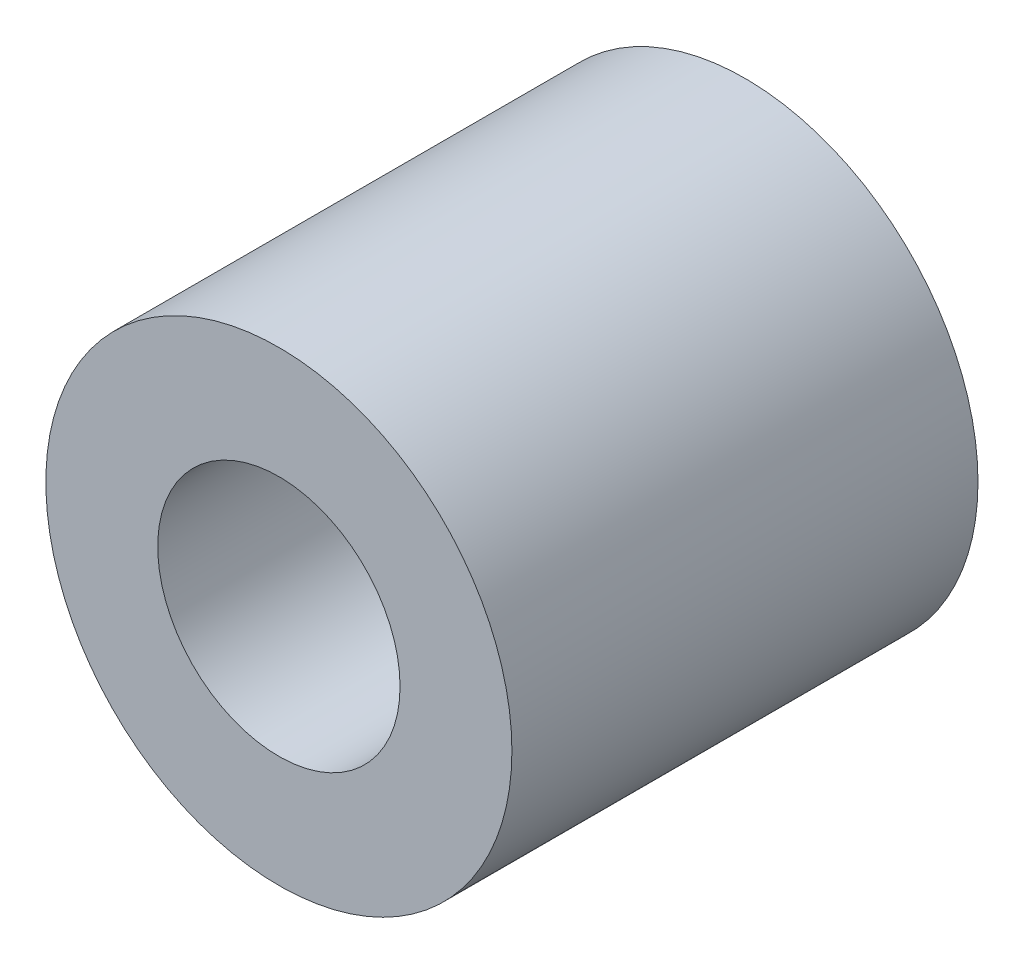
ISO-10303-21;
HEADER;
FILE_DESCRIPTION(('STEP AP214'),'2;1');
FILE_NAME('part.step','',(''),(''),'','','');
FILE_SCHEMA(('AUTOMOTIVE_DESIGN { 1 0 10303 214 1 1 1 1 }'));
ENDSEC;
DATA;
#1=APPLICATION_CONTEXT('core data for automotive mechanical design processes');
#2=APPLICATION_PROTOCOL_DEFINITION('international standard','automotive_design',2000,#1);
#3=PRODUCT_CONTEXT('',#1,'mechanical');
#4=PRODUCT('Part','Part','',(#3));
#5=PRODUCT_RELATED_PRODUCT_CATEGORY('part','',(#4));
#6=PRODUCT_DEFINITION_FORMATION('','',#4);
#7=PRODUCT_DEFINITION_CONTEXT('part definition',#1,'design');
#8=PRODUCT_DEFINITION('design','',#6,#7);
#9=PRODUCT_DEFINITION_SHAPE('','',#8);
#10=(LENGTH_UNIT() NAMED_UNIT(*) SI_UNIT(.MILLI.,.METRE.));
#11=(NAMED_UNIT(*) PLANE_ANGLE_UNIT() SI_UNIT($,.RADIAN.));
#12=(NAMED_UNIT(*) SI_UNIT($,.STERADIAN.) SOLID_ANGLE_UNIT());
#13=UNCERTAINTY_MEASURE_WITH_UNIT(LENGTH_MEASURE(1.E-05),#10,'distance_accuracy_value','');
#14=(GEOMETRIC_REPRESENTATION_CONTEXT(3) GLOBAL_UNCERTAINTY_ASSIGNED_CONTEXT((#13)) GLOBAL_UNIT_ASSIGNED_CONTEXT((#10,
#11,#12)) REPRESENTATION_CONTEXT('',''));
#15=CARTESIAN_POINT('',(0.,0.,0.));
#16=DIRECTION('',(0.,0.,1.));
#17=DIRECTION('',(1.,0.,0.));
#18=AXIS2_PLACEMENT_3D('',#15,#16,#17);
#19=CARTESIAN_POINT('',(0.,0.,40.));
#20=DIRECTION('',(0.,0.,1.));
#21=DIRECTION('',(1.,0.,0.));
#22=AXIS2_PLACEMENT_3D('',#19,#20,#21);
#23=CYLINDRICAL_SURFACE('',#22,8.);
#24=CARTESIAN_POINT('',(0.,0.,0.));
#25=DIRECTION('',(0.,0.,1.));
#26=DIRECTION('',(1.,0.,0.));
#27=AXIS2_PLACEMENT_3D('',#24,#25,#26);
#28=CIRCLE('',#27,8.);
#29=CARTESIAN_POINT('',(8.,0.,0.));
#30=VERTEX_POINT('',#29);
#31=EDGE_CURVE('E8',#30,#30,#28,.T.);
#32=ORIENTED_EDGE('',*,*,#31,.F.);
#33=EDGE_LOOP('',(#32));
#34=FACE_BOUND('',#33,.T.);
#35=CARTESIAN_POINT('',(0.,0.,15.));
#36=DIRECTION('',(0.,0.,1.));
#37=DIRECTION('',(1.,0.,0.));
#38=AXIS2_PLACEMENT_3D('',#35,#36,#37);
#39=CIRCLE('',#38,8.);
#40=CARTESIAN_POINT('',(8.,0.,15.));
#41=VERTEX_POINT('',#40);
#42=EDGE_CURVE('E34',#41,#41,#39,.T.);
#43=ORIENTED_EDGE('',*,*,#42,.T.);
#44=EDGE_LOOP('',(#43));
#45=FACE_BOUND('',#44,.T.);
#46=ADVANCED_FACE('F12',(#34,#45),#23,.F.);
#47=CARTESIAN_POINT('',(8.,0.,0.));
#48=DIRECTION('',(0.,0.,1.));
#49=DIRECTION('',(1.,0.,0.));
#50=AXIS2_PLACEMENT_3D('',#47,#48,#49);
#51=PLANE('',#50);
#52=CARTESIAN_POINT('',(0.,0.,0.));
#53=DIRECTION('',(0.,0.,1.));
#54=DIRECTION('',(1.,0.,0.));
#55=AXIS2_PLACEMENT_3D('',#52,#53,#54);
#56=CIRCLE('',#55,25.);
#57=CARTESIAN_POINT('',(25.,0.,0.));
#58=VERTEX_POINT('',#57);
#59=EDGE_CURVE('E18',#58,#58,#56,.T.);
#60=ORIENTED_EDGE('',*,*,#59,.F.);
#61=EDGE_LOOP('',(#60));
#62=FACE_BOUND('',#61,.T.);
#63=ORIENTED_EDGE('',*,*,#31,.T.);
#64=EDGE_LOOP('',(#63));
#65=FACE_BOUND('',#64,.T.);
#66=ADVANCED_FACE('F59',(#62,#65),#51,.F.);
#67=CARTESIAN_POINT('',(0.,0.,40.));
#68=DIRECTION('',(0.,0.,1.));
#69=DIRECTION('',(1.,0.,0.));
#70=AXIS2_PLACEMENT_3D('',#67,#68,#69);
#71=CYLINDRICAL_SURFACE('',#70,25.);
#72=CARTESIAN_POINT('',(0.,0.,50.));
#73=DIRECTION('',(0.,0.,1.));
#74=DIRECTION('',(1.,0.,0.));
#75=AXIS2_PLACEMENT_3D('',#72,#73,#74);
#76=CIRCLE('',#75,25.);
#77=CARTESIAN_POINT('',(25.,0.,50.));
#78=VERTEX_POINT('',#77);
#79=EDGE_CURVE('E22',#78,#78,#76,.T.);
#80=ORIENTED_EDGE('',*,*,#79,.F.);
#81=EDGE_LOOP('',(#80));
#82=FACE_BOUND('',#81,.T.);
#83=ORIENTED_EDGE('',*,*,#59,.T.);
#84=EDGE_LOOP('',(#83));
#85=FACE_BOUND('',#84,.T.);
#86=ADVANCED_FACE('F54',(#82,#85),#71,.T.);
#87=CARTESIAN_POINT('',(25.,0.,50.));
#88=DIRECTION('',(0.,0.,-1.));
#89=DIRECTION('',(-1.,0.,0.));
#90=AXIS2_PLACEMENT_3D('',#87,#88,#89);
#91=PLANE('',#90);
#92=CARTESIAN_POINT('',(0.,0.,50.));
#93=DIRECTION('',(0.,0.,1.));
#94=DIRECTION('',(1.,0.,0.));
#95=AXIS2_PLACEMENT_3D('',#92,#93,#94);
#96=CIRCLE('',#95,13.);
#97=CARTESIAN_POINT('',(13.,0.,50.));
#98=VERTEX_POINT('',#97);
#99=EDGE_CURVE('E26',#98,#98,#96,.T.);
#100=ORIENTED_EDGE('',*,*,#99,.F.);
#101=EDGE_LOOP('',(#100));
#102=FACE_BOUND('',#101,.T.);
#103=ORIENTED_EDGE('',*,*,#79,.T.);
#104=EDGE_LOOP('',(#103));
#105=FACE_BOUND('',#104,.T.);
#106=ADVANCED_FACE('F48',(#102,#105),#91,.F.);
#107=CARTESIAN_POINT('',(0.,0.,40.));
#108=DIRECTION('',(0.,0.,1.));
#109=DIRECTION('',(1.,0.,0.));
#110=AXIS2_PLACEMENT_3D('',#107,#108,#109);
#111=CYLINDRICAL_SURFACE('',#110,13.);
#112=CARTESIAN_POINT('',(0.,0.,15.));
#113=DIRECTION('',(0.,0.,1.));
#114=DIRECTION('',(1.,0.,0.));
#115=AXIS2_PLACEMENT_3D('',#112,#113,#114);
#116=CIRCLE('',#115,13.);
#117=CARTESIAN_POINT('',(13.,0.,15.));
#118=VERTEX_POINT('',#117);
#119=EDGE_CURVE('E31',#118,#118,#116,.T.);
#120=ORIENTED_EDGE('',*,*,#119,.F.);
#121=EDGE_LOOP('',(#120));
#122=FACE_BOUND('',#121,.T.);
#123=ORIENTED_EDGE('',*,*,#99,.T.);
#124=EDGE_LOOP('',(#123));
#125=FACE_BOUND('',#124,.T.);
#126=ADVANCED_FACE('F42',(#122,#125),#111,.F.);
#127=CARTESIAN_POINT('',(13.,0.,15.));
#128=DIRECTION('',(0.,0.,-1.));
#129=DIRECTION('',(-1.,0.,0.));
#130=AXIS2_PLACEMENT_3D('',#127,#128,#129);
#131=PLANE('',#130);
#132=ORIENTED_EDGE('',*,*,#42,.F.);
#133=EDGE_LOOP('',(#132));
#134=FACE_BOUND('',#133,.T.);
#135=ORIENTED_EDGE('',*,*,#119,.T.);
#136=EDGE_LOOP('',(#135));
#137=FACE_BOUND('',#136,.T.);
#138=ADVANCED_FACE('F39',(#134,#137),#131,.F.);
#139=CLOSED_SHELL('',(#46,#66,#86,#106,#126,#138));
#140=MANIFOLD_SOLID_BREP('B1',#139);
#141=ADVANCED_BREP_SHAPE_REPRESENTATION('',(#18,#140),#14);
#142=SHAPE_DEFINITION_REPRESENTATION(#9,#141);
ENDSEC;
END-ISO-10303-21;
